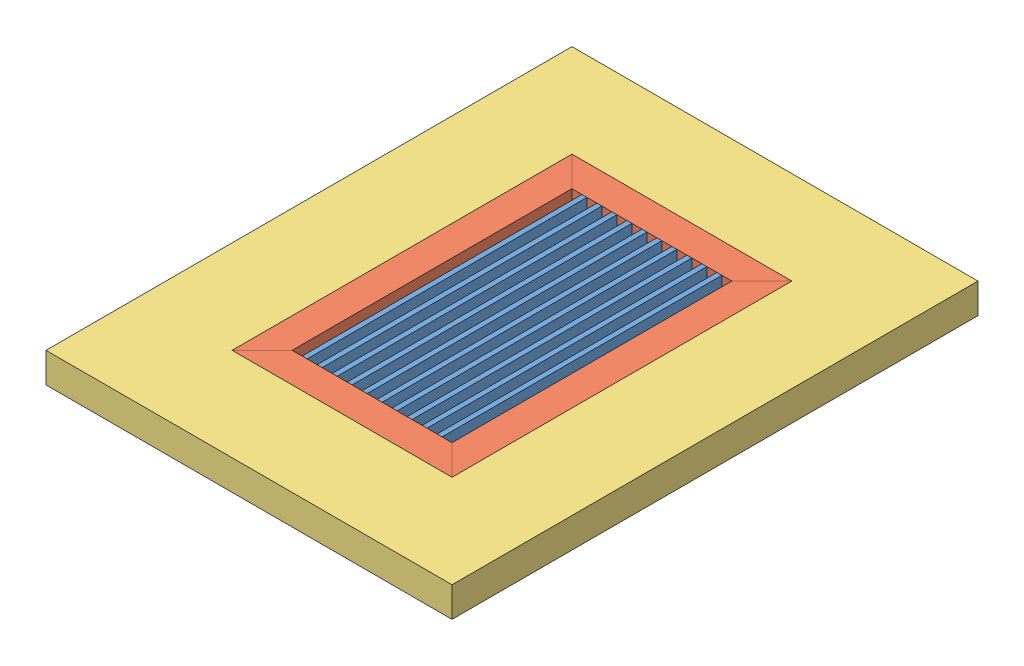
SolidWorks assembly 506(STEP 4).SLDASM, configuration Default (file format 11000). Lengths in mm.
Overall size (257.95 19.05 334.15).
3 component instances, 3 part files, 6 mates.
Components (placement in the parent):
- Standard AG10 Core-1: Standard AG10 Core.SLDPRT [Default] at origin size (101.6 19.05 177.8)
- Standard AG10 B Frame-1: Standard AG10 B Frame.SLDPRT [Default] at (-26.9875 9.525 -88.9) size (139.7 19.05 215.9)
- WallorFloororWood-1: WallorFloororWood.SLDPRT [Default] at (42.8625 -9.525 -88.9) x (0 0 -1) z (1 0 0) size (334.15 19.05 257.95)
Mates (geometry in assembly coordinates):
- Coincident1: coincident: plane of Standard AG10 Core-1 through (-7.9375 0 0) normal (-1 0 0); plane of Standard AG10 B Frame-1 through (-7.9375 9.525 0) normal (1 0 0)
- Coincident2: coincident: plane of Standard AG10 Core-1 through (9.525 0 0) normal (0 0 1); plane of Standard AG10 B Frame-1 through (-26.9875 -134.6429 0) normal (0 0 -1)
- Coincident3: coincident: plane of Standard AG10 Core-1 through (49.2125 9.525 -177.8) normal (0 1 0); plane of Standard AG10 B Frame-1 through (-26.9875 9.525 0) normal (0 1 0)
- Coincident4: coincident: plane of Standard AG10 B Frame-1 through (-11.1125 6.35 0) normal (-1 0 0); plane of WallorFloororWood-1 through (-11.1125 9.525 -180.975) normal (1 0 0)
- Coincident5: coincident: plane of Standard AG10 B Frame-1 through (-11.1125 -117.5217 -180.975) normal (0 0 -1); plane of WallorFloororWood-1 through (96.8375 9.525 -180.975) normal (0 0 1)
- Coincident6: coincident: plane of Standard AG10 B Frame-1 through (-26.9875 6.35 0) normal (0 -1 0); plane of WallorFloororWood-1 through (42.8625 6.35 -88.9) normal (0 1 0)
